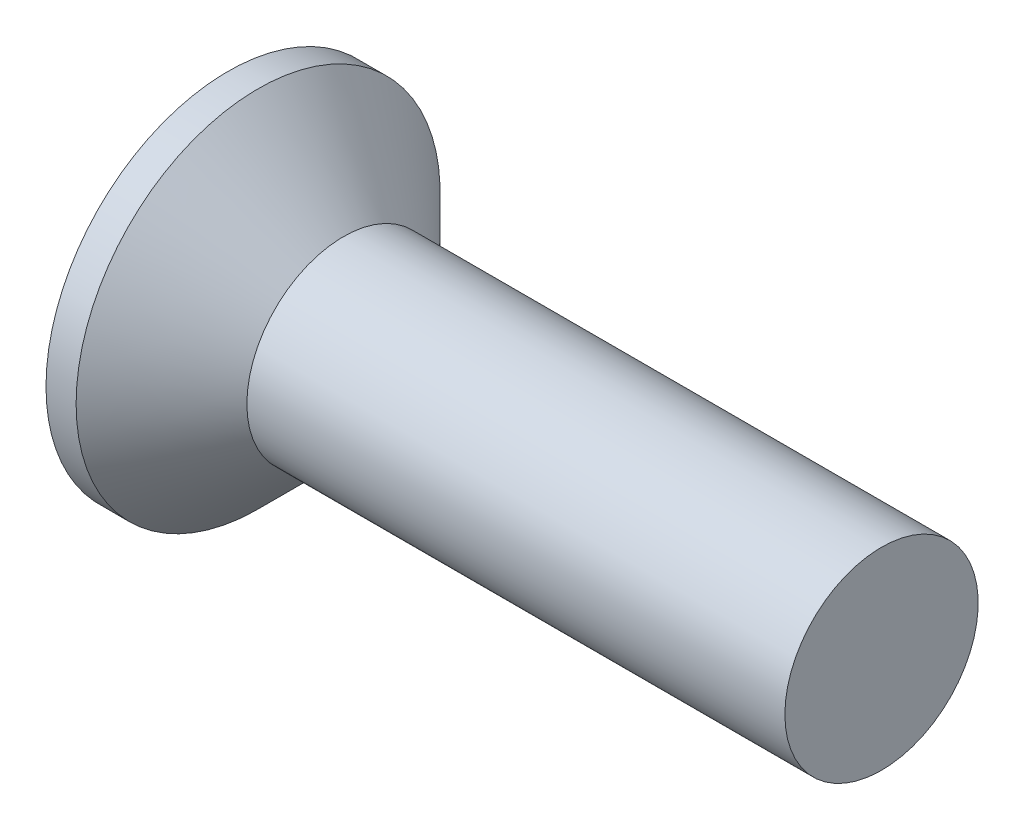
ISO-10303-21;
HEADER;
FILE_DESCRIPTION(('STEP AP214'),'2;1');
FILE_NAME('part.step','',(''),(''),'','','');
FILE_SCHEMA(('AUTOMOTIVE_DESIGN { 1 0 10303 214 1 1 1 1 }'));
ENDSEC;
DATA;
#1=APPLICATION_CONTEXT('core data for automotive mechanical design processes');
#2=APPLICATION_PROTOCOL_DEFINITION('international standard','automotive_design',2000,#1);
#3=PRODUCT_CONTEXT('',#1,'mechanical');
#4=PRODUCT('Part','Part','',(#3));
#5=PRODUCT_RELATED_PRODUCT_CATEGORY('part','',(#4));
#6=PRODUCT_DEFINITION_FORMATION('','',#4);
#7=PRODUCT_DEFINITION_CONTEXT('part definition',#1,'design');
#8=PRODUCT_DEFINITION('design','',#6,#7);
#9=PRODUCT_DEFINITION_SHAPE('','',#8);
#10=(LENGTH_UNIT() NAMED_UNIT(*) SI_UNIT(.MILLI.,.METRE.));
#11=(NAMED_UNIT(*) PLANE_ANGLE_UNIT() SI_UNIT($,.RADIAN.));
#12=(NAMED_UNIT(*) SI_UNIT($,.STERADIAN.) SOLID_ANGLE_UNIT());
#13=UNCERTAINTY_MEASURE_WITH_UNIT(LENGTH_MEASURE(1.E-05),#10,'distance_accuracy_value','');
#14=(GEOMETRIC_REPRESENTATION_CONTEXT(3) GLOBAL_UNCERTAINTY_ASSIGNED_CONTEXT((#13)) GLOBAL_UNIT_ASSIGNED_CONTEXT((#10,
#11,#12)) REPRESENTATION_CONTEXT('',''));
#15=CARTESIAN_POINT('',(0.,0.,0.));
#16=DIRECTION('',(0.,0.,1.));
#17=DIRECTION('',(1.,0.,0.));
#18=AXIS2_PLACEMENT_3D('',#15,#16,#17);
#19=CARTESIAN_POINT('',(14.9,0.,0.));
#20=DIRECTION('',(-1.,0.,0.));
#21=DIRECTION('',(0.,-1.,0.));
#22=AXIS2_PLACEMENT_3D('',#19,#20,#21);
#23=SPHERICAL_SURFACE('',#22,14.9);
#24=CARTESIAN_POINT('',(1.11277765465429,0.,0.));
#25=DIRECTION('',(-1.,0.,0.));
#26=DIRECTION('',(0.,0.,1.));
#27=AXIS2_PLACEMENT_3D('',#24,#25,#26);
#28=CIRCLE('',#27,5.65);
#29=CARTESIAN_POINT('',(1.11277765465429,0.,5.65));
#30=VERTEX_POINT('',#29);
#31=EDGE_CURVE('E158',#30,#30,#28,.T.);
#32=ORIENTED_EDGE('',*,*,#31,.T.);
#33=EDGE_LOOP('',(#32));
#34=FACE_BOUND('',#33,.T.);
#35=CARTESIAN_POINT('',(14.8690356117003,0.,-0.443389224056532));
#36=DIRECTION('',(-0.0696660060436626,0.,-0.997570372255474));
#37=DIRECTION('',(-0.997570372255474,0.,0.0696660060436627));
#38=AXIS2_PLACEMENT_3D('',#35,#36,#37);
#39=CIRCLE('',#38,14.8933692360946);
#40=CARTESIAN_POINT('',(0.390833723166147,3.3424248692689,0.567705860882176));
#41=VERTEX_POINT('',#40);
#42=CARTESIAN_POINT('',(0.0236471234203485,0.593348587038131,0.593348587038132));
#43=VERTEX_POINT('',#42);
#44=EDGE_CURVE('E126',#41,#43,#39,.F.);
#45=ORIENTED_EDGE('',*,*,#44,.T.);
#46=CARTESIAN_POINT('',(14.8690356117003,-0.443389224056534,0.));
#47=DIRECTION('',(-0.0696660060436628,-0.997570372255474,0.));
#48=DIRECTION('',(0.997570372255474,-0.0696660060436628,0.));
#49=AXIS2_PLACEMENT_3D('',#46,#47,#48);
#50=CIRCLE('',#49,14.8933692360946);
#51=CARTESIAN_POINT('',(0.390833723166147,0.567705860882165,3.3424248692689));
#52=VERTEX_POINT('',#51);
#53=EDGE_CURVE('E108',#43,#52,#50,.F.);
#54=ORIENTED_EDGE('',*,*,#53,.T.);
#55=CARTESIAN_POINT('',(10.9752217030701,0.,-4.9871903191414));
#56=DIRECTION('',(0.618432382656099,0.,0.785838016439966));
#57=DIRECTION('',(0.785838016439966,0.,-0.6184323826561));
#58=AXIS2_PLACEMENT_3D('',#55,#56,#57);
#59=CIRCLE('',#58,13.480877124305);
#60=CARTESIAN_POINT('',(0.390833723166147,-0.567705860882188,3.3424248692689));
#61=VERTEX_POINT('',#60);
#62=EDGE_CURVE('E119',#61,#52,#59,.F.);
#63=ORIENTED_EDGE('',*,*,#62,.F.);
#64=CARTESIAN_POINT('',(14.8690356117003,0.443389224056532,0.));
#65=DIRECTION('',(-0.0696660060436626,0.997570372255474,0.));
#66=DIRECTION('',(-0.997570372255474,-0.0696660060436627,0.));
#67=AXIS2_PLACEMENT_3D('',#64,#65,#66);
#68=CIRCLE('',#67,14.8933692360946);
#69=CARTESIAN_POINT('',(0.0236471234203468,-0.593348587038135,0.593348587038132));
#70=VERTEX_POINT('',#69);
#71=EDGE_CURVE('E188',#61,#70,#68,.F.);
#72=ORIENTED_EDGE('',*,*,#71,.T.);
#73=CARTESIAN_POINT('',(0.390833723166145,-3.3424248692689,0.567705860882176));
#74=VERTEX_POINT('',#73);
#75=EDGE_CURVE('E163',#70,#74,#39,.F.);
#76=ORIENTED_EDGE('',*,*,#75,.T.);
#77=CARTESIAN_POINT('',(10.9752217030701,4.9871903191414,0.));
#78=DIRECTION('',(0.6184323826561,-0.785838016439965,0.));
#79=DIRECTION('',(0.785838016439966,0.6184323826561,0.));
#80=AXIS2_PLACEMENT_3D('',#77,#78,#79);
#81=CIRCLE('',#80,13.480877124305);
#82=CARTESIAN_POINT('',(0.390833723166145,-3.3424248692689,-0.567705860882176));
#83=VERTEX_POINT('',#82);
#84=EDGE_CURVE('E161',#83,#74,#81,.F.);
#85=ORIENTED_EDGE('',*,*,#84,.F.);
#86=CARTESIAN_POINT('',(14.8690356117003,0.,0.443389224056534));
#87=DIRECTION('',(-0.0696660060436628,0.,0.997570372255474));
#88=DIRECTION('',(0.997570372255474,0.,0.0696660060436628));
#89=AXIS2_PLACEMENT_3D('',#86,#87,#88);
#90=CIRCLE('',#89,14.8933692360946);
#91=CARTESIAN_POINT('',(0.0236471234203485,-0.59334858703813,-0.593348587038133));
#92=VERTEX_POINT('',#91);
#93=EDGE_CURVE('E165',#83,#92,#90,.F.);
#94=ORIENTED_EDGE('',*,*,#93,.T.);
#95=CARTESIAN_POINT('',(0.390833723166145,-0.567705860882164,-3.3424248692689));
#96=VERTEX_POINT('',#95);
#97=EDGE_CURVE('E192',#92,#96,#68,.F.);
#98=ORIENTED_EDGE('',*,*,#97,.T.);
#99=CARTESIAN_POINT('',(10.9752217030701,0.,4.9871903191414));
#100=DIRECTION('',(0.6184323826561,0.,-0.785838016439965));
#101=DIRECTION('',(-0.785838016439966,0.,-0.6184323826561));
#102=AXIS2_PLACEMENT_3D('',#99,#100,#101);
#103=CIRCLE('',#102,13.480877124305);
#104=CARTESIAN_POINT('',(0.390833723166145,0.567705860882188,-3.3424248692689));
#105=VERTEX_POINT('',#104);
#106=EDGE_CURVE('E120',#105,#96,#103,.F.);
#107=ORIENTED_EDGE('',*,*,#106,.F.);
#108=CARTESIAN_POINT('',(0.0236471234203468,0.593348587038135,-0.593348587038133));
#109=VERTEX_POINT('',#108);
#110=EDGE_CURVE('E145',#105,#109,#50,.F.);
#111=ORIENTED_EDGE('',*,*,#110,.T.);
#112=CARTESIAN_POINT('',(0.390833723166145,3.3424248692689,-0.567705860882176));
#113=VERTEX_POINT('',#112);
#114=EDGE_CURVE('E59',#109,#113,#90,.F.);
#115=ORIENTED_EDGE('',*,*,#114,.T.);
#116=CARTESIAN_POINT('',(10.9752217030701,-4.9871903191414,0.));
#117=DIRECTION('',(0.618432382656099,0.785838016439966,0.));
#118=DIRECTION('',(-0.785838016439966,0.6184323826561,0.));
#119=AXIS2_PLACEMENT_3D('',#116,#117,#118);
#120=CIRCLE('',#119,13.480877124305);
#121=EDGE_CURVE('E44',#41,#113,#120,.F.);
#122=ORIENTED_EDGE('',*,*,#121,.F.);
#123=EDGE_LOOP('',(#45,#54,#63,#72,#76,#85,#94,#98,#107,#111,#115,#122));
#124=FACE_BOUND('',#123,.T.);
#125=ADVANCED_FACE('F36',(#34,#124),#23,.T.);
#126=CARTESIAN_POINT('',(4.63803131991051,0.,-0.271099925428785));
#127=DIRECTION('',(-0.0696660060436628,0.,0.997570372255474));
#128=DIRECTION('',(0.997570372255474,0.,0.0696660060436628));
#129=AXIS2_PLACEMENT_3D('',#126,#127,#128);
#130=PLANE('',#129);
#131=ORIENTED_EDGE('',*,*,#114,.F.);
#132=DIRECTION('',(0.995158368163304,-0.0694975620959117,0.0694975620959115));
#133=VECTOR('',#132,1.);
#134=CARTESIAN_POINT('',(4.65678088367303,0.269790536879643,-0.269790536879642));
#135=LINE('',#134,#133);
#136=CARTESIAN_POINT('',(4.26,0.297500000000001,-0.297499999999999));
#137=VERTEX_POINT('',#136);
#138=EDGE_CURVE('E170',#109,#137,#135,.T.);
#139=ORIENTED_EDGE('',*,*,#138,.T.);
#140=DIRECTION('',(0.784657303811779,-0.617503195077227,0.0547970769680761));
#141=VECTOR('',#140,1.);
#142=CARTESIAN_POINT('',(0.,3.65,-0.595));
#143=LINE('',#142,#141);
#144=EDGE_CURVE('E129',#113,#137,#143,.T.);
#145=ORIENTED_EDGE('',*,*,#144,.F.);
#146=EDGE_LOOP('',(#131,#139,#145));
#147=FACE_BOUND('',#146,.T.);
#148=ADVANCED_FACE('F169',(#147),#130,.T.);
#149=DIRECTION('',(0.784657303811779,0.617503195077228,0.0547970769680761));
#150=VECTOR('',#149,1.);
#151=CARTESIAN_POINT('',(0.,-3.65,-0.595));
#152=LINE('',#151,#150);
#153=CARTESIAN_POINT('',(4.26,-0.2975,-0.2975));
#154=VERTEX_POINT('',#153);
#155=EDGE_CURVE('E51',#83,#154,#152,.T.);
#156=ORIENTED_EDGE('',*,*,#155,.T.);
#157=DIRECTION('',(-0.995158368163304,-0.0694975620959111,-0.0694975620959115));
#158=VECTOR('',#157,1.);
#159=CARTESIAN_POINT('',(4.65678088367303,-0.269790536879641,-0.269790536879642));
#160=LINE('',#159,#158);
#161=EDGE_CURVE('E190',#154,#92,#160,.T.);
#162=ORIENTED_EDGE('',*,*,#161,.T.);
#163=ORIENTED_EDGE('',*,*,#93,.F.);
#164=EDGE_LOOP('',(#156,#162,#163));
#165=FACE_BOUND('',#164,.T.);
#166=ADVANCED_FACE('F214',(#165),#130,.T.);
#167=CARTESIAN_POINT('',(4.63803131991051,0.,0.271099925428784));
#168=DIRECTION('',(-0.0696660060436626,0.,-0.997570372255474));
#169=DIRECTION('',(-0.997570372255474,0.,0.0696660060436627));
#170=AXIS2_PLACEMENT_3D('',#167,#168,#169);
#171=PLANE('',#170);
#172=DIRECTION('',(0.784657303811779,-0.617503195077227,-0.0547970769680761));
#173=VECTOR('',#172,1.);
#174=CARTESIAN_POINT('',(0.,3.65,0.595));
#175=LINE('',#174,#173);
#176=CARTESIAN_POINT('',(4.26,0.297499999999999,0.297500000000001));
#177=VERTEX_POINT('',#176);
#178=EDGE_CURVE('E124',#41,#177,#175,.T.);
#179=ORIENTED_EDGE('',*,*,#178,.T.);
#180=DIRECTION('',(-0.995158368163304,0.0694975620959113,0.0694975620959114));
#181=VECTOR('',#180,1.);
#182=CARTESIAN_POINT('',(4.65678088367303,0.269790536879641,0.269790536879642));
#183=LINE('',#182,#181);
#184=EDGE_CURVE('E11',#177,#43,#183,.T.);
#185=ORIENTED_EDGE('',*,*,#184,.T.);
#186=ORIENTED_EDGE('',*,*,#44,.F.);
#187=EDGE_LOOP('',(#179,#185,#186));
#188=FACE_BOUND('',#187,.T.);
#189=ADVANCED_FACE('F125',(#188),#171,.T.);
#190=ORIENTED_EDGE('',*,*,#75,.F.);
#191=DIRECTION('',(0.995158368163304,0.0694975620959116,-0.0694975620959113));
#192=VECTOR('',#191,1.);
#193=CARTESIAN_POINT('',(4.65678088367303,-0.269790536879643,0.269790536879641));
#194=LINE('',#193,#192);
#195=CARTESIAN_POINT('',(4.26,-0.2975,0.2975));
#196=VERTEX_POINT('',#195);
#197=EDGE_CURVE('E185',#70,#196,#194,.T.);
#198=ORIENTED_EDGE('',*,*,#197,.T.);
#199=DIRECTION('',(0.784657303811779,0.617503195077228,-0.0547970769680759));
#200=VECTOR('',#199,1.);
#201=CARTESIAN_POINT('',(0.,-3.65,0.594999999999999));
#202=LINE('',#201,#200);
#203=EDGE_CURVE('E176',#74,#196,#202,.T.);
#204=ORIENTED_EDGE('',*,*,#203,.F.);
#205=EDGE_LOOP('',(#190,#198,#204));
#206=FACE_BOUND('',#205,.T.);
#207=ADVANCED_FACE('F184',(#206),#171,.T.);
#208=CARTESIAN_POINT('',(21.3974076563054,0.,0.));
#209=DIRECTION('',(-1.,0.,0.));
#210=DIRECTION('',(0.,0.,1.));
#211=AXIS2_PLACEMENT_3D('',#208,#209,#210);
#212=PLANE('',#211);
#213=CARTESIAN_POINT('',(21.3974076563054,0.,0.));
#214=DIRECTION('',(-1.,0.,0.));
#215=DIRECTION('',(0.,0.,1.));
#216=AXIS2_PLACEMENT_3D('',#213,#214,#215);
#217=CIRCLE('',#216,3.);
#218=CARTESIAN_POINT('',(21.3974076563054,0.,3.));
#219=VERTEX_POINT('',#218);
#220=EDGE_CURVE('E149',#219,#219,#217,.T.);
#221=ORIENTED_EDGE('',*,*,#220,.F.);
#222=EDGE_LOOP('',(#221));
#223=FACE_BOUND('',#222,.T.);
#224=ADVANCED_FACE('F38',(#223),#212,.F.);
#225=CARTESIAN_POINT('',(-15.875,0.,0.));
#226=DIRECTION('',(-1.,0.,0.));
#227=DIRECTION('',(0.,0.,1.));
#228=AXIS2_PLACEMENT_3D('',#225,#226,#227);
#229=CYLINDRICAL_SURFACE('',#228,5.65);
#230=ORIENTED_EDGE('',*,*,#31,.F.);
#231=EDGE_LOOP('',(#230));
#232=FACE_BOUND('',#231,.T.);
#233=CARTESIAN_POINT('',(2.04740765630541,0.,0.));
#234=DIRECTION('',(-1.,0.,0.));
#235=DIRECTION('',(0.,0.,1.));
#236=AXIS2_PLACEMENT_3D('',#233,#234,#235);
#237=CIRCLE('',#236,5.65);
#238=CARTESIAN_POINT('',(2.04740765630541,0.,5.65));
#239=VERTEX_POINT('',#238);
#240=EDGE_CURVE('E155',#239,#239,#237,.T.);
#241=ORIENTED_EDGE('',*,*,#240,.T.);
#242=EDGE_LOOP('',(#241));
#243=FACE_BOUND('',#242,.T.);
#244=ADVANCED_FACE('F233',(#232,#243),#229,.T.);
#245=CARTESIAN_POINT('',(4.69740765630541,0.,0.));
#246=DIRECTION('',(-1.,0.,0.));
#247=DIRECTION('',(0.,0.,1.));
#248=AXIS2_PLACEMENT_3D('',#245,#246,#247);
#249=CONICAL_SURFACE('',#248,3.,0.785398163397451);
#250=ORIENTED_EDGE('',*,*,#240,.F.);
#251=EDGE_LOOP('',(#250));
#252=FACE_BOUND('',#251,.T.);
#253=CARTESIAN_POINT('',(4.69740765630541,0.,0.));
#254=DIRECTION('',(-1.,0.,0.));
#255=DIRECTION('',(0.,0.,1.));
#256=AXIS2_PLACEMENT_3D('',#253,#254,#255);
#257=CIRCLE('',#256,3.);
#258=CARTESIAN_POINT('',(4.69740765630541,0.,3.));
#259=VERTEX_POINT('',#258);
#260=EDGE_CURVE('E152',#259,#259,#257,.T.);
#261=ORIENTED_EDGE('',*,*,#260,.T.);
#262=EDGE_LOOP('',(#261));
#263=FACE_BOUND('',#262,.T.);
#264=ADVANCED_FACE('F236',(#252,#263),#249,.T.);
#265=CARTESIAN_POINT('',(-15.875,0.,0.));
#266=DIRECTION('',(-1.,0.,0.));
#267=DIRECTION('',(0.,0.,1.));
#268=AXIS2_PLACEMENT_3D('',#265,#266,#267);
#269=CYLINDRICAL_SURFACE('',#268,3.);
#270=ORIENTED_EDGE('',*,*,#260,.F.);
#271=EDGE_LOOP('',(#270));
#272=FACE_BOUND('',#271,.T.);
#273=ORIENTED_EDGE('',*,*,#220,.T.);
#274=EDGE_LOOP('',(#273));
#275=FACE_BOUND('',#274,.T.);
#276=ADVANCED_FACE('F240',(#272,#275),#269,.T.);
#277=CARTESIAN_POINT('',(4.26,-0.2975,-0.2975));
#278=DIRECTION('',(1.,0.,0.));
#279=DIRECTION('',(0.,0.,-1.));
#280=AXIS2_PLACEMENT_3D('',#277,#278,#279);
#281=PLANE('',#280);
#282=DIRECTION('',(0.,1.,0.));
#283=VECTOR('',#282,1.);
#284=CARTESIAN_POINT('',(4.26,-0.2975,-0.2975));
#285=LINE('',#284,#283);
#286=EDGE_CURVE('E142',#154,#137,#285,.T.);
#287=ORIENTED_EDGE('',*,*,#286,.F.);
#288=DIRECTION('',(0.,0.,1.));
#289=VECTOR('',#288,1.);
#290=CARTESIAN_POINT('',(4.26,-0.2975,-0.2975));
#291=LINE('',#290,#289);
#292=EDGE_CURVE('E137',#154,#196,#291,.T.);
#293=ORIENTED_EDGE('',*,*,#292,.T.);
#294=DIRECTION('',(0.,-1.,0.));
#295=VECTOR('',#294,1.);
#296=CARTESIAN_POINT('',(4.26,0.2975,0.2975));
#297=LINE('',#296,#295);
#298=EDGE_CURVE('E116',#177,#196,#297,.T.);
#299=ORIENTED_EDGE('',*,*,#298,.F.);
#300=DIRECTION('',(0.,0.,-1.));
#301=VECTOR('',#300,1.);
#302=CARTESIAN_POINT('',(4.26,0.2975,0.2975));
#303=LINE('',#302,#301);
#304=EDGE_CURVE('E136',#177,#137,#303,.T.);
#305=ORIENTED_EDGE('',*,*,#304,.T.);
#306=EDGE_LOOP('',(#287,#293,#299,#305));
#307=FACE_BOUND('',#306,.T.);
#308=ADVANCED_FACE('F135',(#307),#281,.F.);
#309=CARTESIAN_POINT('',(0.,3.65,0.595));
#310=DIRECTION('',(0.618432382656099,0.785838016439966,0.));
#311=DIRECTION('',(-0.785838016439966,0.6184323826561,0.));
#312=AXIS2_PLACEMENT_3D('',#309,#310,#311);
#313=PLANE('',#312);
#314=ORIENTED_EDGE('',*,*,#121,.T.);
#315=ORIENTED_EDGE('',*,*,#144,.T.);
#316=ORIENTED_EDGE('',*,*,#304,.F.);
#317=ORIENTED_EDGE('',*,*,#178,.F.);
#318=EDGE_LOOP('',(#314,#315,#316,#317));
#319=FACE_BOUND('',#318,.T.);
#320=ADVANCED_FACE('F140',(#319),#313,.F.);
#321=CARTESIAN_POINT('',(4.26,-0.2975,-0.2975));
#322=DIRECTION('',(0.6184323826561,-0.785838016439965,0.));
#323=DIRECTION('',(0.785838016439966,0.6184323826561,0.));
#324=AXIS2_PLACEMENT_3D('',#321,#322,#323);
#325=PLANE('',#324);
#326=ORIENTED_EDGE('',*,*,#84,.T.);
#327=ORIENTED_EDGE('',*,*,#203,.T.);
#328=ORIENTED_EDGE('',*,*,#292,.F.);
#329=ORIENTED_EDGE('',*,*,#155,.F.);
#330=EDGE_LOOP('',(#326,#327,#328,#329));
#331=FACE_BOUND('',#330,.T.);
#332=ADVANCED_FACE('F179',(#331),#325,.F.);
#333=CARTESIAN_POINT('',(4.63803131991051,0.271099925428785,0.));
#334=DIRECTION('',(-0.0696660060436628,-0.997570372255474,0.));
#335=DIRECTION('',(0.997570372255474,-0.0696660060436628,0.));
#336=AXIS2_PLACEMENT_3D('',#333,#334,#335);
#337=PLANE('',#336);
#338=ORIENTED_EDGE('',*,*,#184,.F.);
#339=DIRECTION('',(0.784657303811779,-0.054797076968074,-0.617503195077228));
#340=VECTOR('',#339,1.);
#341=CARTESIAN_POINT('',(0.,0.594999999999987,3.65));
#342=LINE('',#341,#340);
#343=EDGE_CURVE('E106',#52,#177,#342,.T.);
#344=ORIENTED_EDGE('',*,*,#343,.F.);
#345=ORIENTED_EDGE('',*,*,#53,.F.);
#346=EDGE_LOOP('',(#338,#344,#345));
#347=FACE_BOUND('',#346,.T.);
#348=ADVANCED_FACE('F105',(#347),#337,.T.);
#349=CARTESIAN_POINT('',(4.63803131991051,-0.271099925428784,0.));
#350=DIRECTION('',(-0.0696660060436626,0.997570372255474,0.));
#351=DIRECTION('',(-0.997570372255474,-0.0696660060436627,0.));
#352=AXIS2_PLACEMENT_3D('',#349,#350,#351);
#353=PLANE('',#352);
#354=DIRECTION('',(0.784657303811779,0.0547970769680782,-0.617503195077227));
#355=VECTOR('',#354,1.);
#356=CARTESIAN_POINT('',(0.,-0.595000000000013,3.65));
#357=LINE('',#356,#355);
#358=EDGE_CURVE('E121',#61,#196,#357,.T.);
#359=ORIENTED_EDGE('',*,*,#358,.T.);
#360=ORIENTED_EDGE('',*,*,#197,.F.);
#361=ORIENTED_EDGE('',*,*,#71,.F.);
#362=EDGE_LOOP('',(#359,#360,#361));
#363=FACE_BOUND('',#362,.T.);
#364=ADVANCED_FACE('F215',(#363),#353,.T.);
#365=CARTESIAN_POINT('',(0.,-0.595000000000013,3.65));
#366=DIRECTION('',(0.618432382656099,0.,0.785838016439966));
#367=DIRECTION('',(-0.785838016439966,0.,0.6184323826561));
#368=AXIS2_PLACEMENT_3D('',#365,#366,#367);
#369=PLANE('',#368);
#370=ORIENTED_EDGE('',*,*,#62,.T.);
#371=ORIENTED_EDGE('',*,*,#343,.T.);
#372=ORIENTED_EDGE('',*,*,#298,.T.);
#373=ORIENTED_EDGE('',*,*,#358,.F.);
#374=EDGE_LOOP('',(#370,#371,#372,#373));
#375=FACE_BOUND('',#374,.T.);
#376=ADVANCED_FACE('F113',(#375),#369,.F.);
#377=DIRECTION('',(0.784657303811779,-0.0547970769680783,0.617503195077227));
#378=VECTOR('',#377,1.);
#379=CARTESIAN_POINT('',(0.,0.595000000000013,-3.65));
#380=LINE('',#379,#378);
#381=EDGE_CURVE('E203',#105,#137,#380,.T.);
#382=ORIENTED_EDGE('',*,*,#381,.T.);
#383=ORIENTED_EDGE('',*,*,#138,.F.);
#384=ORIENTED_EDGE('',*,*,#110,.F.);
#385=EDGE_LOOP('',(#382,#383,#384));
#386=FACE_BOUND('',#385,.T.);
#387=ADVANCED_FACE('F202',(#386),#337,.T.);
#388=ORIENTED_EDGE('',*,*,#161,.F.);
#389=DIRECTION('',(0.784657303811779,0.0547970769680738,0.617503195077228));
#390=VECTOR('',#389,1.);
#391=CARTESIAN_POINT('',(0.,-0.594999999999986,-3.65));
#392=LINE('',#391,#390);
#393=EDGE_CURVE('E207',#96,#154,#392,.T.);
#394=ORIENTED_EDGE('',*,*,#393,.F.);
#395=ORIENTED_EDGE('',*,*,#97,.F.);
#396=EDGE_LOOP('',(#388,#394,#395));
#397=FACE_BOUND('',#396,.T.);
#398=ADVANCED_FACE('F212',(#397),#353,.T.);
#399=CARTESIAN_POINT('',(4.26,0.297500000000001,-0.297499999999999));
#400=DIRECTION('',(0.6184323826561,0.,-0.785838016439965));
#401=DIRECTION('',(0.785838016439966,0.,0.6184323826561));
#402=AXIS2_PLACEMENT_3D('',#399,#400,#401);
#403=PLANE('',#402);
#404=ORIENTED_EDGE('',*,*,#106,.T.);
#405=ORIENTED_EDGE('',*,*,#393,.T.);
#406=ORIENTED_EDGE('',*,*,#286,.T.);
#407=ORIENTED_EDGE('',*,*,#381,.F.);
#408=EDGE_LOOP('',(#404,#405,#406,#407));
#409=FACE_BOUND('',#408,.T.);
#410=ADVANCED_FACE('F205',(#409),#403,.F.);
#411=CLOSED_SHELL('',(#125,#148,#166,#189,#207,#224,#244,#264,#276,#308,#320,#332,#348,#364,
#376,#387,#398,#410));
#412=MANIFOLD_SOLID_BREP('B2',#411);
#413=ADVANCED_BREP_SHAPE_REPRESENTATION('',(#18,#412),#14);
#414=SHAPE_DEFINITION_REPRESENTATION(#9,#413);
ENDSEC;
END-ISO-10303-21;
